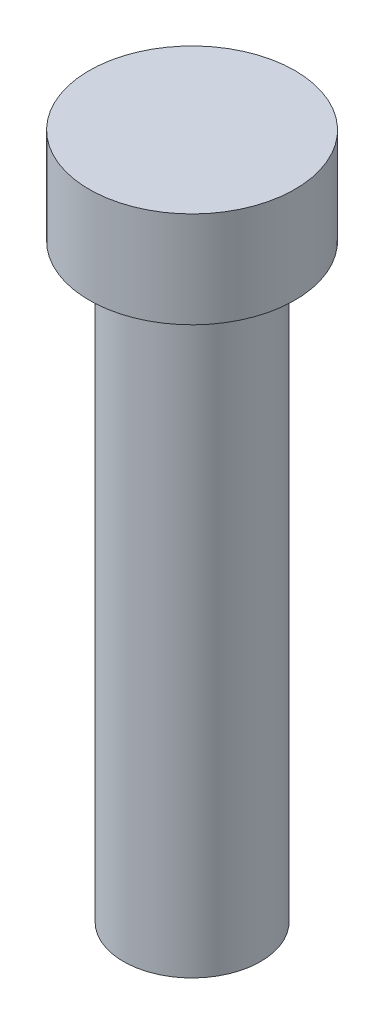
from build123d import *


with BuildPart() as part:
    # Sketch1 → Revolve1 (revolve)
    with BuildSketch(Plane.XY, mode=Mode.PRIVATE) as revolve1_sk:
        Polygon((0, 0), (5, 0), (5, 43), (7.5, 43), (7.5, 50), (0, 50), align=None)
    revolve(revolve1_sk.sketch.rotate(Axis((0, 0, 0), (0, 1, 0)), 90), axis=Axis((0, 0, 0), (0, 1, 0)))


solid = part.part
